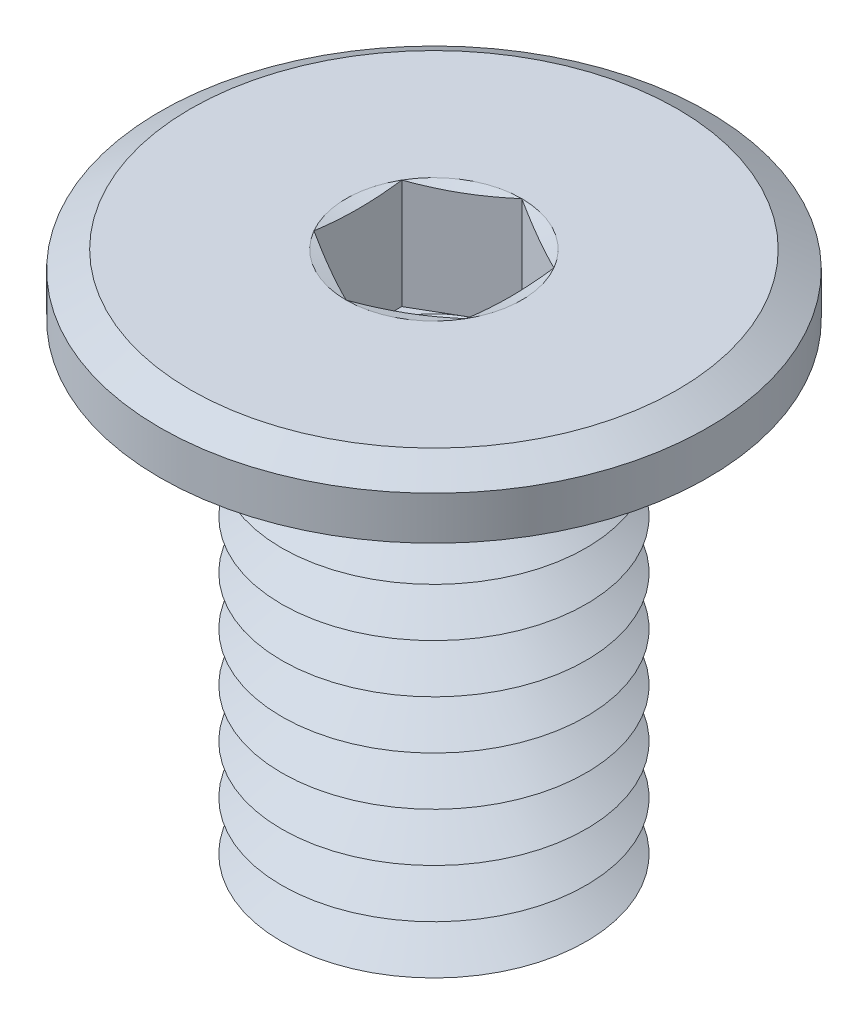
from build123d import *

# Parameters (mm, degrees)
SKETCH1_R           = 4.5
BOSS_EXTRUDE1_DEPTH = 1
SKETCH2_R           = 2.5
BOSS_EXTRUDE2_DEPTH = 8
LPATTERN1_COUNT     = 9
LPATTERN1_PITCH     = 0.8
FILLET1_R           = 0.2
CHAMFER2_SIZE       = 0.5
CHAMFER2_SIZE2      = 0.288675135
CUT_EXTRUDE1_DEPTH  = 1.8


with BuildPart() as part:
    # Sketch1 → Boss-Extrude1 (new body)
    with BuildSketch(Plane(origin=(0, 0, 0), x_dir=(1, 0, 0), z_dir=(0, 1, 0))):
        with Locations(Location((0, 0, 0), (0, 0, 270))):
            Circle(SKETCH1_R)
    extrude(amount=-BOSS_EXTRUDE1_DEPTH)

    # Sketch2 → Boss-Extrude2 (add)
    with BuildSketch(Plane.XZ.offset(1)):
        with Locations(Location((0, 0, 0), (0, 0, 270))):
            Circle(SKETCH2_R)
    extrude(amount=BOSS_EXTRUDE2_DEPTH)

    # Sketch5 → Cut-Revolve1 (revolve, cut)
    with BuildSketch(Plane(origin=(0, 0, 0), x_dir=(0, 0, -1), z_dir=(1, 0, 0))):
        Polygon((-2.5, -9.4), (-1.807179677, -9), (-2.5, -8.6), align=None)
    cut_revolve1 = revolve(axis=Axis((0, 0.990593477, 0), (0, -1, 0)), mode=Mode.SUBTRACT)

    # LPattern1: Cut-Revolve1 ×9
    with Locations(*[(0, i * LPATTERN1_PITCH, 0) for i in range(1, LPATTERN1_COUNT)]):
        add(cut_revolve1, mode=Mode.SUBTRACT)

    # Fillet1
    fillet1_edges = [part.edges().sort_by_distance(p)[0] for p in [
        (0, -1, 2.5),
    ]]
    fillet(fillet1_edges, radius=FILLET1_R)

    # Chamfer2
    chamfer2_edges = [part.edges().sort_by_distance(p)[0] for p in [
        (0, 0, -4.5),
    ]]
    chamfer2_side = [part.faces().sort_by_distance(p)[0] for p in [
        (0, 0, 0),
    ]]
    chamfer(chamfer2_edges, length=CHAMFER2_SIZE, length2=CHAMFER2_SIZE2, reference=chamfer2_side[0])

    # Sketch6 → Cut-Extrude1 (cut)
    with BuildSketch(Plane(origin=(0, 0, 0), x_dir=(1, 0, 0), z_dir=(0, 1, 0))):
        Polygon((0, 1.443375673), (-1.25, 0.721687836), (-1.25, -0.721687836), (0, -1.443375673), (1.25, -0.721687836), (1.25, 0.721687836), align=None)
    extrude(amount=-CUT_EXTRUDE1_DEPTH, mode=Mode.SUBTRACT)

    # Cut-Extrude2 cone 1 section (on through the dimple's axis) → Cut-Extrude2 (revolve, cut)
    with BuildSketch(Plane(origin=(0, -1.8, 0), x_dir=(0, 0, 1), z_dir=(1, 0, 0))):
        Polygon((0, 0), (1.25, 0), (0, 0.721687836), align=None)
    revolve(axis=Axis((0, -1.8, 0), (0, -1, 0)), mode=Mode.SUBTRACT)

    # Cut-Extrude3 cone 1 section (on through the dimple's axis) → Cut-Extrude3 (revolve, cut)
    with BuildSketch(Plane(origin=(0, 0, 0), x_dir=(0, 0, 1), z_dir=(1, 0, 0))):
        Polygon((0, 0), (1.443375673, 0), (0, 0.386751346), align=None)
    revolve(axis=Axis((0, 0, 0), (0, -1, 0)), mode=Mode.SUBTRACT)


solid = part.part
